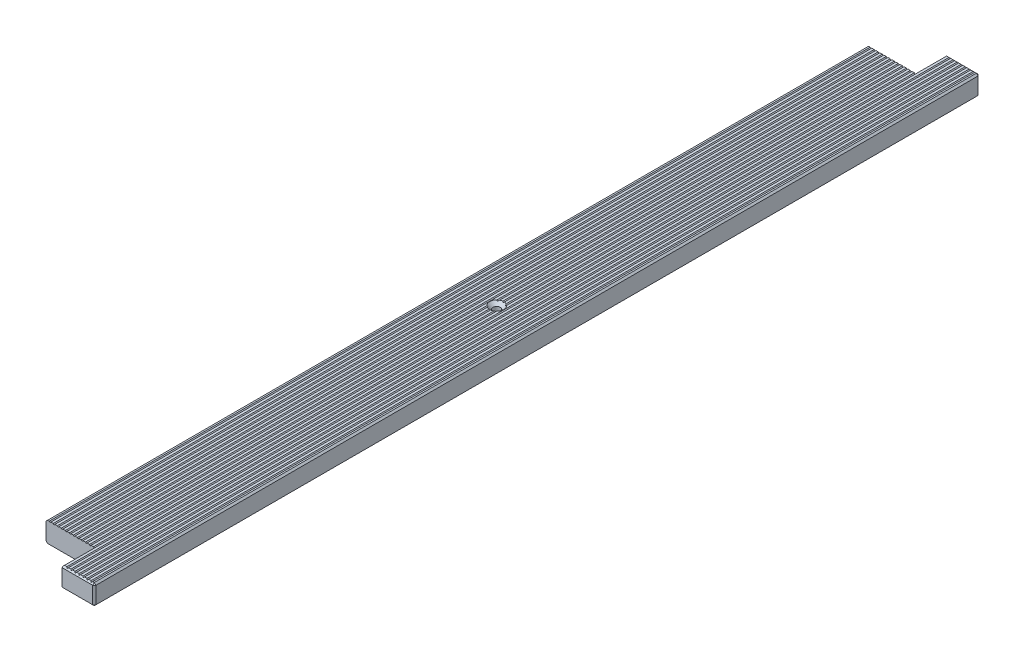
from build123d import *

# Parameters (mm, degrees)
ESQUISSE1_W                                    = 100
ESQUISSE1_H                                    = 25
BOSS_EXTRU_1_DEPTH                             = 550
CHANFREIN1_SIZE                                = 2
ENL_V_MAT_EXTRU_1_DEPTH                        = 1102.206724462
R_P_TITION_LIN_AIRE1_COUNT                     = 19
R_P_TITION_LIN_AIRE1_PITCH                     = 5
FRAISAGE_POUR_VIS_T_TE_FRAIS_E_M81_D           = 9
FRAISAGE_POUR_VIS_T_TE_FRAIS_E_M81_CSINK_D     = 17.3
FRAISAGE_POUR_VIS_T_TE_FRAIS_E_M81_CSINK_ANGLE = 90
ESQUISSE5_W                                    = 60
ESQUISSE5_H                                    = 40
ENL_V_MAT_EXTRU_2_DEPTH                        = 553.833609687


with BuildPart() as part:
    # Esquisse1 → Boss.-Extru.1 (new, symmetric)
    with BuildSketch(Plane.XY):
        Rectangle(ESQUISSE1_W, ESQUISSE1_H)
    extrude(amount=BOSS_EXTRU_1_DEPTH, both=True)

    # Chanfrein1
    chanfrein1_edges = [part.edges().sort_by_distance(p)[0] for p in [
        (-50, 0, 550),
        (0, -12.5, 550),
        (50, 0, 550),
        (0, -12.5, -550),
        (-50, 0, -550),
        (0, 12.5, -550),
        (50, 0, -550),
        (0, 12.5, 550),
        (50, -12.5, 0),
        (-50, -12.5, 0),
        (-50, 12.5, 0),
        (50, 12.5, 0),
    ]]
    chamfer(chanfrein1_edges, length=CHANFREIN1_SIZE)

    # Esquisse2 → Enl_v. mat.-Extru.1 (cut, through all)
    with BuildSketch(Plane.XY.offset(550)):
        Polygon((-46, 12.5), (-44, 12.5), (-45, 11.5), align=None)
    enl_v_mat_extru_1 = extrude(amount=-ENL_V_MAT_EXTRU_1_DEPTH, mode=Mode.SUBTRACT)

    # R_p_tition lin_aire1: Enl_v. mat.-Extru.1 ×19
    with Locations(*[(i * R_P_TITION_LIN_AIRE1_PITCH, 0, 0) for i in range(1, R_P_TITION_LIN_AIRE1_COUNT)]):
        add(enl_v_mat_extru_1, mode=Mode.SUBTRACT)

    # Fraisage pour vis _ t_te frais_e M81 (through all)
    with Locations(Plane(origin=(0, 12.5, 0), x_dir=(-1, 0, 0), z_dir=(0, 1, 0))):
        with Locations((0, -520), (0, 0), (0, 520)):
            CounterSinkHole(FRAISAGE_POUR_VIS_T_TE_FRAIS_E_M81_D / 2, FRAISAGE_POUR_VIS_T_TE_FRAIS_E_M81_CSINK_D / 2, counter_sink_angle=FRAISAGE_POUR_VIS_T_TE_FRAIS_E_M81_CSINK_ANGLE)

    # Esquisse5 → Enl_v. mat.-Extru.2 (cut, through all)
    with BuildSketch(Plane(origin=(0, 12.5, 0), x_dir=(1, 0, 0), z_dir=(0, 1, 0))):
        with Locations((-20, -530)):
            Rectangle(ESQUISSE5_W, ESQUISSE5_H)
        with Locations((-20, 530)):
            Rectangle(ESQUISSE5_W, ESQUISSE5_H)
    extrude(amount=-ENL_V_MAT_EXTRU_2_DEPTH, mode=Mode.SUBTRACT)


solid = part.part
